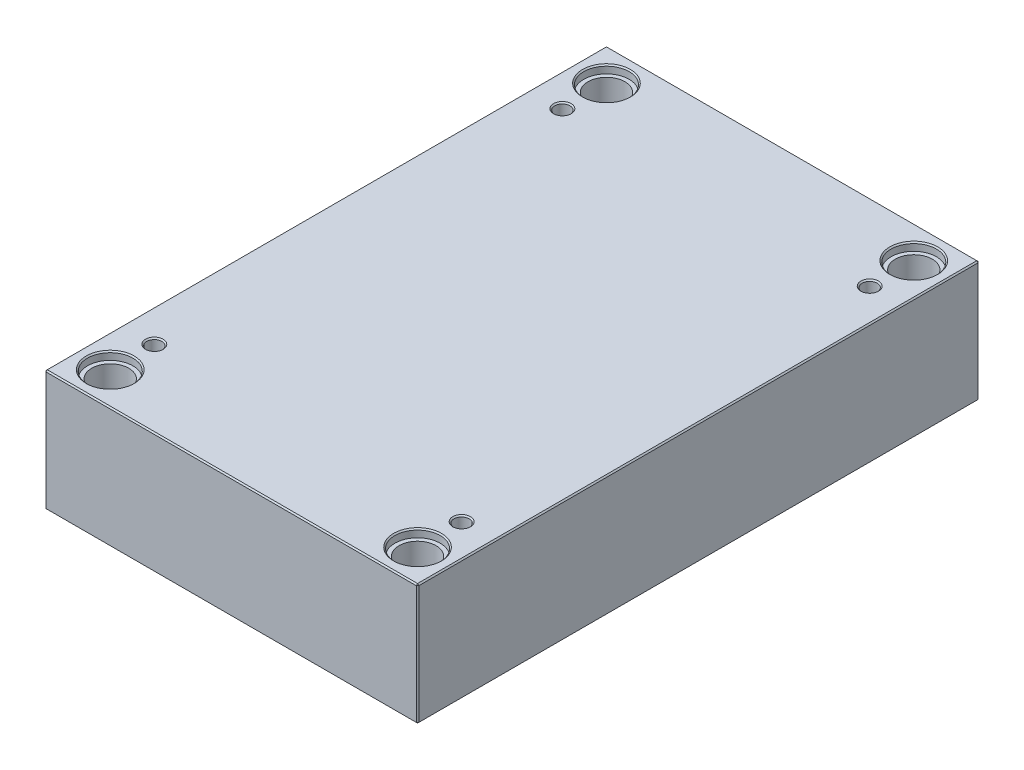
ISO-10303-21;
HEADER;
FILE_DESCRIPTION(('STEP AP214'),'2;1');
FILE_NAME('part.step','',(''),(''),'','','');
FILE_SCHEMA(('AUTOMOTIVE_DESIGN { 1 0 10303 214 1 1 1 1 }'));
ENDSEC;
DATA;
#1=APPLICATION_CONTEXT('core data for automotive mechanical design processes');
#2=APPLICATION_PROTOCOL_DEFINITION('international standard','automotive_design',2000,#1);
#3=PRODUCT_CONTEXT('',#1,'mechanical');
#4=PRODUCT('Part','Part','',(#3));
#5=PRODUCT_RELATED_PRODUCT_CATEGORY('part','',(#4));
#6=PRODUCT_DEFINITION_FORMATION('','',#4);
#7=PRODUCT_DEFINITION_CONTEXT('part definition',#1,'design');
#8=PRODUCT_DEFINITION('design','',#6,#7);
#9=PRODUCT_DEFINITION_SHAPE('','',#8);
#10=(LENGTH_UNIT() NAMED_UNIT(*) SI_UNIT(.MILLI.,.METRE.));
#11=(NAMED_UNIT(*) PLANE_ANGLE_UNIT() SI_UNIT($,.RADIAN.));
#12=(NAMED_UNIT(*) SI_UNIT($,.STERADIAN.) SOLID_ANGLE_UNIT());
#13=UNCERTAINTY_MEASURE_WITH_UNIT(LENGTH_MEASURE(1.E-05),#10,'distance_accuracy_value','');
#14=(GEOMETRIC_REPRESENTATION_CONTEXT(3) GLOBAL_UNCERTAINTY_ASSIGNED_CONTEXT((#13)) GLOBAL_UNIT_ASSIGNED_CONTEXT((#10,
#11,#12)) REPRESENTATION_CONTEXT('',''));
#15=CARTESIAN_POINT('',(0.,0.,0.));
#16=DIRECTION('',(0.,0.,1.));
#17=DIRECTION('',(1.,0.,0.));
#18=AXIS2_PLACEMENT_3D('',#15,#16,#17);
#19=CARTESIAN_POINT('',(-122.,0.,-197.));
#20=DIRECTION('',(0.,1.,0.));
#21=DIRECTION('',(0.,0.,1.));
#22=AXIS2_PLACEMENT_3D('',#19,#20,#21);
#23=CYLINDRICAL_SURFACE('',#22,14.7);
#24=CARTESIAN_POINT('',(-122.,0.999999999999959,-197.));
#25=DIRECTION('',(0.,1.,0.));
#26=DIRECTION('',(0.,0.,1.));
#27=AXIS2_PLACEMENT_3D('',#24,#25,#26);
#28=CIRCLE('',#27,14.7);
#29=CARTESIAN_POINT('',(-122.,0.999999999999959,-182.3));
#30=VERTEX_POINT('',#29);
#31=EDGE_CURVE('E471',#30,#30,#28,.F.);
#32=ORIENTED_EDGE('',*,*,#31,.T.);
#33=EDGE_LOOP('',(#32));
#34=FACE_BOUND('',#33,.T.);
#35=CARTESIAN_POINT('',(-122.,89.7,-197.));
#36=DIRECTION('',(0.,1.,0.));
#37=DIRECTION('',(0.,0.,1.));
#38=AXIS2_PLACEMENT_3D('',#35,#36,#37);
#39=CIRCLE('',#38,14.7);
#40=CARTESIAN_POINT('',(-122.,89.7,-182.3));
#41=VERTEX_POINT('',#40);
#42=EDGE_CURVE('E220',#41,#41,#39,.F.);
#43=ORIENTED_EDGE('',*,*,#42,.F.);
#44=EDGE_LOOP('',(#43));
#45=FACE_BOUND('',#44,.T.);
#46=ADVANCED_FACE('F15',(#34,#45),#23,.F.);
#47=CARTESIAN_POINT('',(122.,0.,-197.));
#48=DIRECTION('',(0.,1.,0.));
#49=DIRECTION('',(0.,0.,1.));
#50=AXIS2_PLACEMENT_3D('',#47,#48,#49);
#51=CYLINDRICAL_SURFACE('',#50,14.7);
#52=CARTESIAN_POINT('',(122.,0.999999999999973,-197.));
#53=DIRECTION('',(0.,1.,0.));
#54=DIRECTION('',(0.,0.,1.));
#55=AXIS2_PLACEMENT_3D('',#52,#53,#54);
#56=CIRCLE('',#55,14.7);
#57=CARTESIAN_POINT('',(122.,0.999999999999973,-182.3));
#58=VERTEX_POINT('',#57);
#59=EDGE_CURVE('E473',#58,#58,#56,.F.);
#60=ORIENTED_EDGE('',*,*,#59,.T.);
#61=EDGE_LOOP('',(#60));
#62=FACE_BOUND('',#61,.T.);
#63=CARTESIAN_POINT('',(122.,89.7,-197.));
#64=DIRECTION('',(0.,1.,0.));
#65=DIRECTION('',(0.,0.,1.));
#66=AXIS2_PLACEMENT_3D('',#63,#64,#65);
#67=CIRCLE('',#66,14.7);
#68=CARTESIAN_POINT('',(122.,89.7,-182.3));
#69=VERTEX_POINT('',#68);
#70=EDGE_CURVE('E217',#69,#69,#67,.F.);
#71=ORIENTED_EDGE('',*,*,#70,.F.);
#72=EDGE_LOOP('',(#71));
#73=FACE_BOUND('',#72,.T.);
#74=ADVANCED_FACE('F262',(#62,#73),#51,.F.);
#75=CARTESIAN_POINT('',(122.,0.,197.));
#76=DIRECTION('',(0.,1.,0.));
#77=DIRECTION('',(0.,0.,1.));
#78=AXIS2_PLACEMENT_3D('',#75,#76,#77);
#79=CYLINDRICAL_SURFACE('',#78,14.7);
#80=CARTESIAN_POINT('',(122.,0.999999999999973,197.));
#81=DIRECTION('',(0.,1.,0.));
#82=DIRECTION('',(0.,0.,1.));
#83=AXIS2_PLACEMENT_3D('',#80,#81,#82);
#84=CIRCLE('',#83,14.7);
#85=CARTESIAN_POINT('',(122.,0.999999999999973,211.7));
#86=VERTEX_POINT('',#85);
#87=EDGE_CURVE('E476',#86,#86,#84,.F.);
#88=ORIENTED_EDGE('',*,*,#87,.T.);
#89=EDGE_LOOP('',(#88));
#90=FACE_BOUND('',#89,.T.);
#91=CARTESIAN_POINT('',(122.,89.7,197.));
#92=DIRECTION('',(0.,1.,0.));
#93=DIRECTION('',(0.,0.,1.));
#94=AXIS2_PLACEMENT_3D('',#91,#92,#93);
#95=CIRCLE('',#94,14.7);
#96=CARTESIAN_POINT('',(122.,89.7,211.7));
#97=VERTEX_POINT('',#96);
#98=EDGE_CURVE('E213',#97,#97,#95,.F.);
#99=ORIENTED_EDGE('',*,*,#98,.F.);
#100=EDGE_LOOP('',(#99));
#101=FACE_BOUND('',#100,.T.);
#102=ADVANCED_FACE('F269',(#90,#101),#79,.F.);
#103=CARTESIAN_POINT('',(-122.,0.,197.));
#104=DIRECTION('',(0.,1.,0.));
#105=DIRECTION('',(0.,0.,1.));
#106=AXIS2_PLACEMENT_3D('',#103,#104,#105);
#107=CYLINDRICAL_SURFACE('',#106,14.7);
#108=CARTESIAN_POINT('',(-122.,0.999999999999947,197.));
#109=DIRECTION('',(0.,1.,0.));
#110=DIRECTION('',(0.,0.,1.));
#111=AXIS2_PLACEMENT_3D('',#108,#109,#110);
#112=CIRCLE('',#111,14.7);
#113=CARTESIAN_POINT('',(-122.,0.999999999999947,211.7));
#114=VERTEX_POINT('',#113);
#115=EDGE_CURVE('E479',#114,#114,#112,.F.);
#116=ORIENTED_EDGE('',*,*,#115,.T.);
#117=EDGE_LOOP('',(#116));
#118=FACE_BOUND('',#117,.T.);
#119=CARTESIAN_POINT('',(-122.,89.7,197.));
#120=DIRECTION('',(0.,1.,0.));
#121=DIRECTION('',(0.,0.,1.));
#122=AXIS2_PLACEMENT_3D('',#119,#120,#121);
#123=CIRCLE('',#122,14.7);
#124=CARTESIAN_POINT('',(-122.,89.7,211.7));
#125=VERTEX_POINT('',#124);
#126=EDGE_CURVE('E210',#125,#125,#123,.F.);
#127=ORIENTED_EDGE('',*,*,#126,.F.);
#128=EDGE_LOOP('',(#127));
#129=FACE_BOUND('',#128,.T.);
#130=ADVANCED_FACE('F276',(#118,#129),#107,.F.);
#131=CARTESIAN_POINT('',(-148.,96.,223.));
#132=DIRECTION('',(1.,0.,0.));
#133=DIRECTION('',(0.,0.,-1.));
#134=AXIS2_PLACEMENT_3D('',#131,#132,#133);
#135=PLANE('',#134);
#136=DIRECTION('',(0.,-1.,0.));
#137=VECTOR('',#136,1.);
#138=CARTESIAN_POINT('',(-148.,96.,-222.));
#139=LINE('',#138,#137);
#140=CARTESIAN_POINT('',(-148.,95.,-222.));
#141=VERTEX_POINT('',#140);
#142=CARTESIAN_POINT('',(-148.,1.,-222.));
#143=VERTEX_POINT('',#142);
#144=EDGE_CURVE('E486',#141,#143,#139,.T.);
#145=ORIENTED_EDGE('',*,*,#144,.T.);
#146=DIRECTION('',(0.,0.,1.));
#147=VECTOR('',#146,1.);
#148=CARTESIAN_POINT('',(-148.,1.,223.));
#149=LINE('',#148,#147);
#150=CARTESIAN_POINT('',(-148.,1.,222.));
#151=VERTEX_POINT('',#150);
#152=EDGE_CURVE('E489',#143,#151,#149,.T.);
#153=ORIENTED_EDGE('',*,*,#152,.T.);
#154=DIRECTION('',(0.,1.,0.));
#155=VECTOR('',#154,1.);
#156=CARTESIAN_POINT('',(-148.,96.,222.));
#157=LINE('',#156,#155);
#158=CARTESIAN_POINT('',(-148.,95.,222.));
#159=VERTEX_POINT('',#158);
#160=EDGE_CURVE('E484',#151,#159,#157,.T.);
#161=ORIENTED_EDGE('',*,*,#160,.T.);
#162=DIRECTION('',(0.,0.,-1.));
#163=VECTOR('',#162,1.);
#164=CARTESIAN_POINT('',(-148.,95.,-223.));
#165=LINE('',#164,#163);
#166=EDGE_CURVE('E482',#159,#141,#165,.T.);
#167=ORIENTED_EDGE('',*,*,#166,.T.);
#168=EDGE_LOOP('',(#145,#153,#161,#167));
#169=FACE_BOUND('',#168,.T.);
#170=ADVANCED_FACE('F297',(#169),#135,.F.);
#171=CARTESIAN_POINT('',(148.,96.,223.));
#172=DIRECTION('',(0.,0.,-1.));
#173=DIRECTION('',(-1.,0.,0.));
#174=AXIS2_PLACEMENT_3D('',#171,#172,#173);
#175=PLANE('',#174);
#176=DIRECTION('',(-1.,0.,0.));
#177=VECTOR('',#176,1.);
#178=CARTESIAN_POINT('',(-148.,95.,223.));
#179=LINE('',#178,#177);
#180=CARTESIAN_POINT('',(147.,95.,223.));
#181=VERTEX_POINT('',#180);
#182=CARTESIAN_POINT('',(-147.,95.,223.));
#183=VERTEX_POINT('',#182);
#184=EDGE_CURVE('E508',#181,#183,#179,.T.);
#185=ORIENTED_EDGE('',*,*,#184,.T.);
#186=DIRECTION('',(0.,-1.,0.));
#187=VECTOR('',#186,1.);
#188=CARTESIAN_POINT('',(-147.,96.,223.));
#189=LINE('',#188,#187);
#190=CARTESIAN_POINT('',(-147.,1.,223.));
#191=VERTEX_POINT('',#190);
#192=EDGE_CURVE('E514',#183,#191,#189,.T.);
#193=ORIENTED_EDGE('',*,*,#192,.T.);
#194=DIRECTION('',(1.,0.,0.));
#195=VECTOR('',#194,1.);
#196=CARTESIAN_POINT('',(148.,1.,223.));
#197=LINE('',#196,#195);
#198=CARTESIAN_POINT('',(147.,1.,223.));
#199=VERTEX_POINT('',#198);
#200=EDGE_CURVE('E512',#191,#199,#197,.T.);
#201=ORIENTED_EDGE('',*,*,#200,.T.);
#202=DIRECTION('',(0.,1.,0.));
#203=VECTOR('',#202,1.);
#204=CARTESIAN_POINT('',(147.,96.,223.));
#205=LINE('',#204,#203);
#206=EDGE_CURVE('E510',#199,#181,#205,.T.);
#207=ORIENTED_EDGE('',*,*,#206,.T.);
#208=EDGE_LOOP('',(#185,#193,#201,#207));
#209=FACE_BOUND('',#208,.T.);
#210=ADVANCED_FACE('F293',(#209),#175,.F.);
#211=CARTESIAN_POINT('',(148.,96.,223.));
#212=DIRECTION('',(-1.,0.,0.));
#213=DIRECTION('',(0.,0.,1.));
#214=AXIS2_PLACEMENT_3D('',#211,#212,#213);
#215=PLANE('',#214);
#216=DIRECTION('',(0.,0.,-1.));
#217=VECTOR('',#216,1.);
#218=CARTESIAN_POINT('',(148.,1.,223.));
#219=LINE('',#218,#217);
#220=CARTESIAN_POINT('',(148.,1.,222.));
#221=VERTEX_POINT('',#220);
#222=CARTESIAN_POINT('',(148.,1.,-222.));
#223=VERTEX_POINT('',#222);
#224=EDGE_CURVE('E503',#221,#223,#219,.T.);
#225=ORIENTED_EDGE('',*,*,#224,.T.);
#226=DIRECTION('',(0.,1.,0.));
#227=VECTOR('',#226,1.);
#228=CARTESIAN_POINT('',(148.,96.,-222.));
#229=LINE('',#228,#227);
#230=CARTESIAN_POINT('',(148.,95.,-222.));
#231=VERTEX_POINT('',#230);
#232=EDGE_CURVE('E505',#223,#231,#229,.T.);
#233=ORIENTED_EDGE('',*,*,#232,.T.);
#234=DIRECTION('',(0.,0.,1.));
#235=VECTOR('',#234,1.);
#236=CARTESIAN_POINT('',(148.,95.,223.));
#237=LINE('',#236,#235);
#238=CARTESIAN_POINT('',(148.,95.,222.));
#239=VERTEX_POINT('',#238);
#240=EDGE_CURVE('E499',#231,#239,#237,.T.);
#241=ORIENTED_EDGE('',*,*,#240,.T.);
#242=DIRECTION('',(0.,-1.,0.));
#243=VECTOR('',#242,1.);
#244=CARTESIAN_POINT('',(148.,96.,222.));
#245=LINE('',#244,#243);
#246=EDGE_CURVE('E501',#239,#221,#245,.T.);
#247=ORIENTED_EDGE('',*,*,#246,.T.);
#248=EDGE_LOOP('',(#225,#233,#241,#247));
#249=FACE_BOUND('',#248,.T.);
#250=ADVANCED_FACE('F289',(#249),#215,.F.);
#251=CARTESIAN_POINT('',(148.,96.,-223.));
#252=DIRECTION('',(0.,0.,1.));
#253=DIRECTION('',(1.,0.,0.));
#254=AXIS2_PLACEMENT_3D('',#251,#252,#253);
#255=PLANE('',#254);
#256=DIRECTION('',(0.,-1.,0.));
#257=VECTOR('',#256,1.);
#258=CARTESIAN_POINT('',(147.,96.,-223.));
#259=LINE('',#258,#257);
#260=CARTESIAN_POINT('',(147.,95.,-223.));
#261=VERTEX_POINT('',#260);
#262=CARTESIAN_POINT('',(147.,1.,-223.));
#263=VERTEX_POINT('',#262);
#264=EDGE_CURVE('E493',#261,#263,#259,.T.);
#265=ORIENTED_EDGE('',*,*,#264,.T.);
#266=DIRECTION('',(-1.,0.,0.));
#267=VECTOR('',#266,1.);
#268=CARTESIAN_POINT('',(148.,1.,-223.));
#269=LINE('',#268,#267);
#270=CARTESIAN_POINT('',(-147.,1.,-223.));
#271=VERTEX_POINT('',#270);
#272=EDGE_CURVE('E137',#263,#271,#269,.T.);
#273=ORIENTED_EDGE('',*,*,#272,.T.);
#274=DIRECTION('',(0.,1.,0.));
#275=VECTOR('',#274,1.);
#276=CARTESIAN_POINT('',(-147.,96.,-223.));
#277=LINE('',#276,#275);
#278=CARTESIAN_POINT('',(-147.,95.,-223.));
#279=VERTEX_POINT('',#278);
#280=EDGE_CURVE('E495',#271,#279,#277,.T.);
#281=ORIENTED_EDGE('',*,*,#280,.T.);
#282=DIRECTION('',(1.,0.,0.));
#283=VECTOR('',#282,1.);
#284=CARTESIAN_POINT('',(148.,95.,-223.));
#285=LINE('',#284,#283);
#286=EDGE_CURVE('E491',#279,#261,#285,.T.);
#287=ORIENTED_EDGE('',*,*,#286,.T.);
#288=EDGE_LOOP('',(#265,#273,#281,#287));
#289=FACE_BOUND('',#288,.T.);
#290=ADVANCED_FACE('F281',(#289),#255,.F.);
#291=CARTESIAN_POINT('',(0.,96.,0.));
#292=DIRECTION('',(0.,1.,0.));
#293=DIRECTION('',(0.,0.,1.));
#294=AXIS2_PLACEMENT_3D('',#291,#292,#293);
#295=PLANE('',#294);
#296=CARTESIAN_POINT('',(122.,96.,197.));
#297=DIRECTION('',(0.,1.,0.));
#298=DIRECTION('',(0.,0.,1.));
#299=AXIS2_PLACEMENT_3D('',#296,#297,#298);
#300=CIRCLE('',#299,19.);
#301=CARTESIAN_POINT('',(122.,96.,216.));
#302=VERTEX_POINT('',#301);
#303=EDGE_CURVE('E235',#302,#302,#300,.F.);
#304=ORIENTED_EDGE('',*,*,#303,.T.);
#305=EDGE_LOOP('',(#304));
#306=FACE_BOUND('',#305,.T.);
#307=CARTESIAN_POINT('',(-122.,96.,197.));
#308=DIRECTION('',(0.,1.,0.));
#309=DIRECTION('',(0.,0.,1.));
#310=AXIS2_PLACEMENT_3D('',#307,#308,#309);
#311=CIRCLE('',#310,19.);
#312=CARTESIAN_POINT('',(-122.,96.,216.));
#313=VERTEX_POINT('',#312);
#314=EDGE_CURVE('E232',#313,#313,#311,.F.);
#315=ORIENTED_EDGE('',*,*,#314,.T.);
#316=EDGE_LOOP('',(#315));
#317=FACE_BOUND('',#316,.T.);
#318=CARTESIAN_POINT('',(122.,96.,-197.));
#319=DIRECTION('',(0.,1.,0.));
#320=DIRECTION('',(0.,0.,1.));
#321=AXIS2_PLACEMENT_3D('',#318,#319,#320);
#322=CIRCLE('',#321,19.);
#323=CARTESIAN_POINT('',(122.,96.,-178.));
#324=VERTEX_POINT('',#323);
#325=EDGE_CURVE('E229',#324,#324,#322,.F.);
#326=ORIENTED_EDGE('',*,*,#325,.T.);
#327=EDGE_LOOP('',(#326));
#328=FACE_BOUND('',#327,.T.);
#329=CARTESIAN_POINT('',(-122.,96.,-197.));
#330=DIRECTION('',(0.,1.,0.));
#331=DIRECTION('',(0.,0.,1.));
#332=AXIS2_PLACEMENT_3D('',#329,#330,#331);
#333=CIRCLE('',#332,19.);
#334=CARTESIAN_POINT('',(-122.,96.,-178.));
#335=VERTEX_POINT('',#334);
#336=EDGE_CURVE('E226',#335,#335,#333,.F.);
#337=ORIENTED_EDGE('',*,*,#336,.T.);
#338=EDGE_LOOP('',(#337));
#339=FACE_BOUND('',#338,.T.);
#340=CARTESIAN_POINT('',(-122.,96.,162.));
#341=DIRECTION('',(0.,1.,0.));
#342=DIRECTION('',(0.,0.,1.));
#343=AXIS2_PLACEMENT_3D('',#340,#341,#342);
#344=CIRCLE('',#343,7.);
#345=CARTESIAN_POINT('',(-122.,96.,169.));
#346=VERTEX_POINT('',#345);
#347=EDGE_CURVE('E197',#346,#346,#344,.F.);
#348=ORIENTED_EDGE('',*,*,#347,.T.);
#349=EDGE_LOOP('',(#348));
#350=FACE_BOUND('',#349,.T.);
#351=CARTESIAN_POINT('',(122.,96.,162.));
#352=DIRECTION('',(0.,1.,0.));
#353=DIRECTION('',(0.,0.,1.));
#354=AXIS2_PLACEMENT_3D('',#351,#352,#353);
#355=CIRCLE('',#354,7.);
#356=CARTESIAN_POINT('',(122.,96.,169.));
#357=VERTEX_POINT('',#356);
#358=EDGE_CURVE('E194',#357,#357,#355,.F.);
#359=ORIENTED_EDGE('',*,*,#358,.T.);
#360=EDGE_LOOP('',(#359));
#361=FACE_BOUND('',#360,.T.);
#362=CARTESIAN_POINT('',(122.,96.,-162.));
#363=DIRECTION('',(0.,1.,0.));
#364=DIRECTION('',(0.,0.,1.));
#365=AXIS2_PLACEMENT_3D('',#362,#363,#364);
#366=CIRCLE('',#365,7.);
#367=CARTESIAN_POINT('',(122.,96.,-155.));
#368=VERTEX_POINT('',#367);
#369=EDGE_CURVE('E191',#368,#368,#366,.F.);
#370=ORIENTED_EDGE('',*,*,#369,.T.);
#371=EDGE_LOOP('',(#370));
#372=FACE_BOUND('',#371,.T.);
#373=CARTESIAN_POINT('',(-122.,96.,-162.));
#374=DIRECTION('',(0.,1.,0.));
#375=DIRECTION('',(0.,0.,1.));
#376=AXIS2_PLACEMENT_3D('',#373,#374,#375);
#377=CIRCLE('',#376,7.);
#378=CARTESIAN_POINT('',(-122.,96.,-155.));
#379=VERTEX_POINT('',#378);
#380=EDGE_CURVE('E187',#379,#379,#377,.F.);
#381=ORIENTED_EDGE('',*,*,#380,.T.);
#382=EDGE_LOOP('',(#381));
#383=FACE_BOUND('',#382,.T.);
#384=DIRECTION('',(0.,0.,-1.));
#385=VECTOR('',#384,1.);
#386=CARTESIAN_POINT('',(147.,96.,-223.));
#387=LINE('',#386,#385);
#388=CARTESIAN_POINT('',(147.,96.,222.));
#389=VERTEX_POINT('',#388);
#390=CARTESIAN_POINT('',(147.,96.,-222.));
#391=VERTEX_POINT('',#390);
#392=EDGE_CURVE('E30',#389,#391,#387,.T.);
#393=ORIENTED_EDGE('',*,*,#392,.T.);
#394=DIRECTION('',(-1.,0.,0.));
#395=VECTOR('',#394,1.);
#396=CARTESIAN_POINT('',(-148.,96.,-222.));
#397=LINE('',#396,#395);
#398=CARTESIAN_POINT('',(-147.,96.,-222.));
#399=VERTEX_POINT('',#398);
#400=EDGE_CURVE('E188',#391,#399,#397,.T.);
#401=ORIENTED_EDGE('',*,*,#400,.T.);
#402=DIRECTION('',(0.,0.,1.));
#403=VECTOR('',#402,1.);
#404=CARTESIAN_POINT('',(-147.,96.,223.));
#405=LINE('',#404,#403);
#406=CARTESIAN_POINT('',(-147.,96.,222.));
#407=VERTEX_POINT('',#406);
#408=EDGE_CURVE('E517',#399,#407,#405,.T.);
#409=ORIENTED_EDGE('',*,*,#408,.T.);
#410=DIRECTION('',(1.,0.,0.));
#411=VECTOR('',#410,1.);
#412=CARTESIAN_POINT('',(148.,96.,222.));
#413=LINE('',#412,#411);
#414=EDGE_CURVE('E35',#407,#389,#413,.T.);
#415=ORIENTED_EDGE('',*,*,#414,.T.);
#416=EDGE_LOOP('',(#393,#401,#409,#415));
#417=FACE_BOUND('',#416,.T.);
#418=ADVANCED_FACE('F278',(#306,#317,#328,#339,#350,#361,#372,#383,#417),#295,.T.);
#419=CARTESIAN_POINT('',(0.,0.,0.));
#420=DIRECTION('',(0.,1.,0.));
#421=DIRECTION('',(0.,0.,1.));
#422=AXIS2_PLACEMENT_3D('',#419,#420,#421);
#423=PLANE('',#422);
#424=CARTESIAN_POINT('',(-122.,0.,-197.));
#425=DIRECTION('',(0.,1.,0.));
#426=DIRECTION('',(0.,0.,1.));
#427=AXIS2_PLACEMENT_3D('',#424,#425,#426);
#428=CIRCLE('',#427,15.7);
#429=CARTESIAN_POINT('',(-122.,0.,-181.3));
#430=VERTEX_POINT('',#429);
#431=EDGE_CURVE('E468',#430,#430,#428,.T.);
#432=ORIENTED_EDGE('',*,*,#431,.T.);
#433=EDGE_LOOP('',(#432));
#434=FACE_BOUND('',#433,.T.);
#435=CARTESIAN_POINT('',(122.,0.,-197.));
#436=DIRECTION('',(0.,1.,0.));
#437=DIRECTION('',(0.,0.,1.));
#438=AXIS2_PLACEMENT_3D('',#435,#436,#437);
#439=CIRCLE('',#438,15.7);
#440=CARTESIAN_POINT('',(122.,0.,-181.3));
#441=VERTEX_POINT('',#440);
#442=EDGE_CURVE('E465',#441,#441,#439,.T.);
#443=ORIENTED_EDGE('',*,*,#442,.T.);
#444=EDGE_LOOP('',(#443));
#445=FACE_BOUND('',#444,.T.);
#446=CARTESIAN_POINT('',(122.,0.,197.));
#447=DIRECTION('',(0.,1.,0.));
#448=DIRECTION('',(0.,0.,1.));
#449=AXIS2_PLACEMENT_3D('',#446,#447,#448);
#450=CIRCLE('',#449,15.7);
#451=CARTESIAN_POINT('',(122.,0.,212.7));
#452=VERTEX_POINT('',#451);
#453=EDGE_CURVE('E462',#452,#452,#450,.T.);
#454=ORIENTED_EDGE('',*,*,#453,.T.);
#455=EDGE_LOOP('',(#454));
#456=FACE_BOUND('',#455,.T.);
#457=CARTESIAN_POINT('',(-122.,0.,197.));
#458=DIRECTION('',(0.,1.,0.));
#459=DIRECTION('',(0.,0.,1.));
#460=AXIS2_PLACEMENT_3D('',#457,#458,#459);
#461=CIRCLE('',#460,15.7);
#462=CARTESIAN_POINT('',(-122.,0.,212.7));
#463=VERTEX_POINT('',#462);
#464=EDGE_CURVE('E459',#463,#463,#461,.T.);
#465=ORIENTED_EDGE('',*,*,#464,.T.);
#466=EDGE_LOOP('',(#465));
#467=FACE_BOUND('',#466,.T.);
#468=DIRECTION('',(0.,0.,1.));
#469=VECTOR('',#468,1.);
#470=CARTESIAN_POINT('',(147.,0.,0.));
#471=LINE('',#470,#469);
#472=CARTESIAN_POINT('',(147.,0.,-222.));
#473=VERTEX_POINT('',#472);
#474=CARTESIAN_POINT('',(147.,0.,222.));
#475=VERTEX_POINT('',#474);
#476=EDGE_CURVE('E107',#473,#475,#471,.T.);
#477=ORIENTED_EDGE('',*,*,#476,.T.);
#478=DIRECTION('',(-1.,0.,0.));
#479=VECTOR('',#478,1.);
#480=CARTESIAN_POINT('',(0.,0.,222.));
#481=LINE('',#480,#479);
#482=CARTESIAN_POINT('',(-147.,0.,222.));
#483=VERTEX_POINT('',#482);
#484=EDGE_CURVE('E457',#475,#483,#481,.T.);
#485=ORIENTED_EDGE('',*,*,#484,.T.);
#486=DIRECTION('',(0.,0.,-1.));
#487=VECTOR('',#486,1.);
#488=CARTESIAN_POINT('',(-147.,0.,0.));
#489=LINE('',#488,#487);
#490=CARTESIAN_POINT('',(-147.,0.,-222.));
#491=VERTEX_POINT('',#490);
#492=EDGE_CURVE('E109',#483,#491,#489,.T.);
#493=ORIENTED_EDGE('',*,*,#492,.T.);
#494=DIRECTION('',(1.,0.,0.));
#495=VECTOR('',#494,1.);
#496=CARTESIAN_POINT('',(0.,0.,-222.));
#497=LINE('',#496,#495);
#498=EDGE_CURVE('E103',#491,#473,#497,.T.);
#499=ORIENTED_EDGE('',*,*,#498,.T.);
#500=EDGE_LOOP('',(#477,#485,#493,#499));
#501=FACE_BOUND('',#500,.T.);
#502=ADVANCED_FACE('F105',(#434,#445,#456,#467,#501),#423,.F.);
#503=CARTESIAN_POINT('',(-122.,0.,-197.));
#504=DIRECTION('',(0.,-1.,0.));
#505=DIRECTION('',(0.,0.,-1.));
#506=AXIS2_PLACEMENT_3D('',#503,#504,#505);
#507=CONICAL_SURFACE('',#506,15.7,0.78539816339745);
#508=ORIENTED_EDGE('',*,*,#31,.F.);
#509=EDGE_LOOP('',(#508));
#510=FACE_BOUND('',#509,.T.);
#511=ORIENTED_EDGE('',*,*,#431,.F.);
#512=EDGE_LOOP('',(#511));
#513=FACE_BOUND('',#512,.T.);
#514=ADVANCED_FACE('F285',(#510,#513),#507,.F.);
#515=CARTESIAN_POINT('',(122.,0.,-197.));
#516=DIRECTION('',(0.,-1.,0.));
#517=DIRECTION('',(0.,0.,-1.));
#518=AXIS2_PLACEMENT_3D('',#515,#516,#517);
#519=CONICAL_SURFACE('',#518,15.7,0.78539816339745);
#520=ORIENTED_EDGE('',*,*,#59,.F.);
#521=EDGE_LOOP('',(#520));
#522=FACE_BOUND('',#521,.T.);
#523=ORIENTED_EDGE('',*,*,#442,.F.);
#524=EDGE_LOOP('',(#523));
#525=FACE_BOUND('',#524,.T.);
#526=ADVANCED_FACE('F304',(#522,#525),#519,.F.);
#527=CARTESIAN_POINT('',(122.,0.,197.));
#528=DIRECTION('',(0.,-1.,0.));
#529=DIRECTION('',(0.,0.,-1.));
#530=AXIS2_PLACEMENT_3D('',#527,#528,#529);
#531=CONICAL_SURFACE('',#530,15.7,0.78539816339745);
#532=ORIENTED_EDGE('',*,*,#87,.F.);
#533=EDGE_LOOP('',(#532));
#534=FACE_BOUND('',#533,.T.);
#535=ORIENTED_EDGE('',*,*,#453,.F.);
#536=EDGE_LOOP('',(#535));
#537=FACE_BOUND('',#536,.T.);
#538=ADVANCED_FACE('F308',(#534,#537),#531,.F.);
#539=CARTESIAN_POINT('',(-122.,0.,197.));
#540=DIRECTION('',(0.,-1.,0.));
#541=DIRECTION('',(0.,0.,-1.));
#542=AXIS2_PLACEMENT_3D('',#539,#540,#541);
#543=CONICAL_SURFACE('',#542,15.7,0.78539816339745);
#544=ORIENTED_EDGE('',*,*,#115,.F.);
#545=EDGE_LOOP('',(#544));
#546=FACE_BOUND('',#545,.T.);
#547=ORIENTED_EDGE('',*,*,#464,.F.);
#548=EDGE_LOOP('',(#547));
#549=FACE_BOUND('',#548,.T.);
#550=ADVANCED_FACE('F312',(#546,#549),#543,.F.);
#551=CARTESIAN_POINT('',(148.,96.,222.));
#552=DIRECTION('',(-0.707106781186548,0.,-0.707106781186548));
#553=DIRECTION('',(0.,-1.,0.));
#554=AXIS2_PLACEMENT_3D('',#551,#552,#553);
#555=PLANE('',#554);
#556=DIRECTION('',(-0.707106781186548,0.,0.707106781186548));
#557=VECTOR('',#556,1.);
#558=CARTESIAN_POINT('',(147.,95.,223.));
#559=LINE('',#558,#557);
#560=EDGE_CURVE('E125',#181,#239,#559,.F.);
#561=ORIENTED_EDGE('',*,*,#560,.F.);
#562=ORIENTED_EDGE('',*,*,#206,.F.);
#563=DIRECTION('',(0.707106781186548,0.,-0.707106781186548));
#564=VECTOR('',#563,1.);
#565=CARTESIAN_POINT('',(147.,1.,223.));
#566=LINE('',#565,#564);
#567=EDGE_CURVE('E179',#221,#199,#566,.F.);
#568=ORIENTED_EDGE('',*,*,#567,.F.);
#569=ORIENTED_EDGE('',*,*,#246,.F.);
#570=EDGE_LOOP('',(#561,#562,#568,#569));
#571=FACE_BOUND('',#570,.T.);
#572=ADVANCED_FACE('F316',(#571),#555,.F.);
#573=CARTESIAN_POINT('',(147.,95.,223.));
#574=DIRECTION('',(0.577350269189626,0.577350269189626,0.577350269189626));
#575=DIRECTION('',(0.707106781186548,0.,-0.707106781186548));
#576=AXIS2_PLACEMENT_3D('',#573,#574,#575);
#577=PLANE('',#576);
#578=DIRECTION('',(0.,-0.707106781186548,0.707106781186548));
#579=VECTOR('',#578,1.);
#580=CARTESIAN_POINT('',(147.,95.,223.));
#581=LINE('',#580,#579);
#582=EDGE_CURVE('E174',#181,#389,#581,.F.);
#583=ORIENTED_EDGE('',*,*,#582,.F.);
#584=ORIENTED_EDGE('',*,*,#560,.T.);
#585=DIRECTION('',(-0.707106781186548,0.707106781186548,0.));
#586=VECTOR('',#585,1.);
#587=CARTESIAN_POINT('',(147.5,95.5,222.));
#588=LINE('',#587,#586);
#589=EDGE_CURVE('E176',#389,#239,#588,.F.);
#590=ORIENTED_EDGE('',*,*,#589,.F.);
#591=EDGE_LOOP('',(#583,#584,#590));
#592=FACE_BOUND('',#591,.T.);
#593=ADVANCED_FACE('F384',(#592),#577,.T.);
#594=CARTESIAN_POINT('',(147.,1.,223.));
#595=DIRECTION('',(0.577350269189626,-0.577350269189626,0.577350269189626));
#596=DIRECTION('',(0.707106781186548,0.,-0.707106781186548));
#597=AXIS2_PLACEMENT_3D('',#594,#595,#596);
#598=PLANE('',#597);
#599=DIRECTION('',(-0.707106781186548,-0.707106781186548,0.));
#600=VECTOR('',#599,1.);
#601=CARTESIAN_POINT('',(147.5,0.5,222.));
#602=LINE('',#601,#600);
#603=EDGE_CURVE('E123',#221,#475,#602,.T.);
#604=ORIENTED_EDGE('',*,*,#603,.F.);
#605=ORIENTED_EDGE('',*,*,#567,.T.);
#606=DIRECTION('',(0.,0.707106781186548,0.707106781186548));
#607=VECTOR('',#606,1.);
#608=CARTESIAN_POINT('',(147.,1.,223.));
#609=LINE('',#608,#607);
#610=EDGE_CURVE('E171',#475,#199,#609,.T.);
#611=ORIENTED_EDGE('',*,*,#610,.F.);
#612=EDGE_LOOP('',(#604,#605,#611));
#613=FACE_BOUND('',#612,.T.);
#614=ADVANCED_FACE('F380',(#613),#598,.T.);
#615=CARTESIAN_POINT('',(147.,96.,0.));
#616=DIRECTION('',(0.707106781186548,0.707106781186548,0.));
#617=DIRECTION('',(0.,0.,1.));
#618=AXIS2_PLACEMENT_3D('',#615,#616,#617);
#619=PLANE('',#618);
#620=ORIENTED_EDGE('',*,*,#589,.T.);
#621=ORIENTED_EDGE('',*,*,#240,.F.);
#622=DIRECTION('',(0.707106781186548,-0.707106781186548,0.));
#623=VECTOR('',#622,1.);
#624=CARTESIAN_POINT('',(148.,95.,-222.));
#625=LINE('',#624,#623);
#626=EDGE_CURVE('E165',#391,#231,#625,.T.);
#627=ORIENTED_EDGE('',*,*,#626,.F.);
#628=ORIENTED_EDGE('',*,*,#392,.F.);
#629=EDGE_LOOP('',(#620,#621,#627,#628));
#630=FACE_BOUND('',#629,.T.);
#631=ADVANCED_FACE('F376',(#630),#619,.T.);
#632=CARTESIAN_POINT('',(0.,96.,222.));
#633=DIRECTION('',(0.,0.707106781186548,0.707106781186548));
#634=DIRECTION('',(-1.,0.,0.));
#635=AXIS2_PLACEMENT_3D('',#632,#633,#634);
#636=PLANE('',#635);
#637=ORIENTED_EDGE('',*,*,#582,.T.);
#638=ORIENTED_EDGE('',*,*,#414,.F.);
#639=DIRECTION('',(0.,0.707106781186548,-0.707106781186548));
#640=VECTOR('',#639,1.);
#641=CARTESIAN_POINT('',(-147.,95.5,222.5));
#642=LINE('',#641,#640);
#643=EDGE_CURVE('E162',#183,#407,#642,.T.);
#644=ORIENTED_EDGE('',*,*,#643,.F.);
#645=ORIENTED_EDGE('',*,*,#184,.F.);
#646=EDGE_LOOP('',(#637,#638,#644,#645));
#647=FACE_BOUND('',#646,.T.);
#648=ADVANCED_FACE('F372',(#647),#636,.T.);
#649=CARTESIAN_POINT('',(-147.,96.,223.));
#650=DIRECTION('',(0.707106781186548,0.,-0.707106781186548));
#651=DIRECTION('',(0.,-1.,0.));
#652=AXIS2_PLACEMENT_3D('',#649,#650,#651);
#653=PLANE('',#652);
#654=DIRECTION('',(0.707106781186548,0.,0.707106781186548));
#655=VECTOR('',#654,1.);
#656=CARTESIAN_POINT('',(-147.,1.,223.));
#657=LINE('',#656,#655);
#658=EDGE_CURVE('E156',#191,#151,#657,.F.);
#659=ORIENTED_EDGE('',*,*,#658,.F.);
#660=ORIENTED_EDGE('',*,*,#192,.F.);
#661=DIRECTION('',(-0.707106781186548,0.,-0.707106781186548));
#662=VECTOR('',#661,1.);
#663=CARTESIAN_POINT('',(-148.,95.,222.));
#664=LINE('',#663,#662);
#665=EDGE_CURVE('E159',#159,#183,#664,.F.);
#666=ORIENTED_EDGE('',*,*,#665,.F.);
#667=ORIENTED_EDGE('',*,*,#160,.F.);
#668=EDGE_LOOP('',(#659,#660,#666,#667));
#669=FACE_BOUND('',#668,.T.);
#670=ADVANCED_FACE('F368',(#669),#653,.F.);
#671=CARTESIAN_POINT('',(148.,1.,223.));
#672=DIRECTION('',(0.,0.707106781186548,-0.707106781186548));
#673=DIRECTION('',(1.,0.,0.));
#674=AXIS2_PLACEMENT_3D('',#671,#672,#673);
#675=PLANE('',#674);
#676=ORIENTED_EDGE('',*,*,#610,.T.);
#677=ORIENTED_EDGE('',*,*,#200,.F.);
#678=DIRECTION('',(0.,-0.707106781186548,-0.707106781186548));
#679=VECTOR('',#678,1.);
#680=CARTESIAN_POINT('',(-147.,1.,223.));
#681=LINE('',#680,#679);
#682=EDGE_CURVE('E134',#483,#191,#681,.F.);
#683=ORIENTED_EDGE('',*,*,#682,.F.);
#684=ORIENTED_EDGE('',*,*,#484,.F.);
#685=EDGE_LOOP('',(#676,#677,#683,#684));
#686=FACE_BOUND('',#685,.T.);
#687=ADVANCED_FACE('F365',(#686),#675,.F.);
#688=CARTESIAN_POINT('',(148.,1.,223.));
#689=DIRECTION('',(-0.707106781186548,0.707106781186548,0.));
#690=DIRECTION('',(0.,0.,-1.));
#691=AXIS2_PLACEMENT_3D('',#688,#689,#690);
#692=PLANE('',#691);
#693=ORIENTED_EDGE('',*,*,#603,.T.);
#694=ORIENTED_EDGE('',*,*,#476,.F.);
#695=DIRECTION('',(0.707106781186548,0.707106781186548,0.));
#696=VECTOR('',#695,1.);
#697=CARTESIAN_POINT('',(147.5,0.5,-222.));
#698=LINE('',#697,#696);
#699=EDGE_CURVE('E120',#223,#473,#698,.F.);
#700=ORIENTED_EDGE('',*,*,#699,.F.);
#701=ORIENTED_EDGE('',*,*,#224,.F.);
#702=EDGE_LOOP('',(#693,#694,#700,#701));
#703=FACE_BOUND('',#702,.T.);
#704=ADVANCED_FACE('F118',(#703),#692,.F.);
#705=CARTESIAN_POINT('',(147.,96.,-223.));
#706=DIRECTION('',(-0.707106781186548,0.,0.707106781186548));
#707=DIRECTION('',(0.,-1.,0.));
#708=AXIS2_PLACEMENT_3D('',#705,#706,#707);
#709=PLANE('',#708);
#710=DIRECTION('',(0.707106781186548,0.,0.707106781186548));
#711=VECTOR('',#710,1.);
#712=CARTESIAN_POINT('',(148.,95.,-222.));
#713=LINE('',#712,#711);
#714=EDGE_CURVE('E167',#231,#261,#713,.F.);
#715=ORIENTED_EDGE('',*,*,#714,.F.);
#716=ORIENTED_EDGE('',*,*,#232,.F.);
#717=DIRECTION('',(-0.707106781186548,0.,-0.707106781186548));
#718=VECTOR('',#717,1.);
#719=CARTESIAN_POINT('',(147.,1.,-223.));
#720=LINE('',#719,#718);
#721=EDGE_CURVE('E133',#263,#223,#720,.F.);
#722=ORIENTED_EDGE('',*,*,#721,.F.);
#723=ORIENTED_EDGE('',*,*,#264,.F.);
#724=EDGE_LOOP('',(#715,#716,#722,#723));
#725=FACE_BOUND('',#724,.T.);
#726=ADVANCED_FACE('F358',(#725),#709,.F.);
#727=CARTESIAN_POINT('',(148.,95.,-222.));
#728=DIRECTION('',(0.577350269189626,0.577350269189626,-0.577350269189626));
#729=DIRECTION('',(-0.707106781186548,0.,-0.707106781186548));
#730=AXIS2_PLACEMENT_3D('',#727,#728,#729);
#731=PLANE('',#730);
#732=ORIENTED_EDGE('',*,*,#626,.T.);
#733=ORIENTED_EDGE('',*,*,#714,.T.);
#734=DIRECTION('',(0.,0.707106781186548,0.707106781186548));
#735=VECTOR('',#734,1.);
#736=CARTESIAN_POINT('',(147.,95.5,-222.5));
#737=LINE('',#736,#735);
#738=EDGE_CURVE('E151',#391,#261,#737,.F.);
#739=ORIENTED_EDGE('',*,*,#738,.F.);
#740=EDGE_LOOP('',(#732,#733,#739));
#741=FACE_BOUND('',#740,.T.);
#742=ADVANCED_FACE('F354',(#741),#731,.T.);
#743=CARTESIAN_POINT('',(-148.,95.,222.));
#744=DIRECTION('',(-0.577350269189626,0.577350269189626,0.577350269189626));
#745=DIRECTION('',(0.707106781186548,0.,0.707106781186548));
#746=AXIS2_PLACEMENT_3D('',#743,#744,#745);
#747=PLANE('',#746);
#748=ORIENTED_EDGE('',*,*,#665,.T.);
#749=ORIENTED_EDGE('',*,*,#643,.T.);
#750=DIRECTION('',(-0.707106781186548,-0.707106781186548,0.));
#751=VECTOR('',#750,1.);
#752=CARTESIAN_POINT('',(-148.,95.,222.));
#753=LINE('',#752,#751);
#754=EDGE_CURVE('E142',#159,#407,#753,.F.);
#755=ORIENTED_EDGE('',*,*,#754,.F.);
#756=EDGE_LOOP('',(#748,#749,#755));
#757=FACE_BOUND('',#756,.T.);
#758=ADVANCED_FACE('F350',(#757),#747,.T.);
#759=CARTESIAN_POINT('',(-147.,1.,223.));
#760=DIRECTION('',(-0.577350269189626,-0.577350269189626,0.577350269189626));
#761=DIRECTION('',(0.707106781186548,0.,0.707106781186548));
#762=AXIS2_PLACEMENT_3D('',#759,#760,#761);
#763=PLANE('',#762);
#764=ORIENTED_EDGE('',*,*,#682,.T.);
#765=ORIENTED_EDGE('',*,*,#658,.T.);
#766=DIRECTION('',(-0.707106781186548,0.707106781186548,0.));
#767=VECTOR('',#766,1.);
#768=CARTESIAN_POINT('',(-147.5,0.5,222.));
#769=LINE('',#768,#767);
#770=EDGE_CURVE('E138',#483,#151,#769,.T.);
#771=ORIENTED_EDGE('',*,*,#770,.F.);
#772=EDGE_LOOP('',(#764,#765,#771));
#773=FACE_BOUND('',#772,.T.);
#774=ADVANCED_FACE('F347',(#773),#763,.T.);
#775=CARTESIAN_POINT('',(147.,1.,-223.));
#776=DIRECTION('',(0.577350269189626,-0.577350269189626,-0.577350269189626));
#777=DIRECTION('',(-0.707106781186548,0.,-0.707106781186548));
#778=AXIS2_PLACEMENT_3D('',#775,#776,#777);
#779=PLANE('',#778);
#780=ORIENTED_EDGE('',*,*,#721,.T.);
#781=ORIENTED_EDGE('',*,*,#699,.T.);
#782=DIRECTION('',(0.,-0.707106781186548,0.707106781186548));
#783=VECTOR('',#782,1.);
#784=CARTESIAN_POINT('',(147.,1.,-223.));
#785=LINE('',#784,#783);
#786=EDGE_CURVE('E130',#263,#473,#785,.T.);
#787=ORIENTED_EDGE('',*,*,#786,.F.);
#788=EDGE_LOOP('',(#780,#781,#787));
#789=FACE_BOUND('',#788,.T.);
#790=ADVANCED_FACE('F129',(#789),#779,.T.);
#791=CARTESIAN_POINT('',(0.,96.,-222.));
#792=DIRECTION('',(0.,0.707106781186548,-0.707106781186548));
#793=DIRECTION('',(1.,0.,0.));
#794=AXIS2_PLACEMENT_3D('',#791,#792,#793);
#795=PLANE('',#794);
#796=ORIENTED_EDGE('',*,*,#738,.T.);
#797=ORIENTED_EDGE('',*,*,#286,.F.);
#798=DIRECTION('',(0.,-0.707106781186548,-0.707106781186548));
#799=VECTOR('',#798,1.);
#800=CARTESIAN_POINT('',(-147.,95.,-223.));
#801=LINE('',#800,#799);
#802=EDGE_CURVE('E139',#399,#279,#801,.T.);
#803=ORIENTED_EDGE('',*,*,#802,.F.);
#804=ORIENTED_EDGE('',*,*,#400,.F.);
#805=EDGE_LOOP('',(#796,#797,#803,#804));
#806=FACE_BOUND('',#805,.T.);
#807=ADVANCED_FACE('F340',(#806),#795,.T.);
#808=CARTESIAN_POINT('',(-147.,96.,0.));
#809=DIRECTION('',(-0.707106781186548,0.707106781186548,0.));
#810=DIRECTION('',(0.,0.,-1.));
#811=AXIS2_PLACEMENT_3D('',#808,#809,#810);
#812=PLANE('',#811);
#813=ORIENTED_EDGE('',*,*,#754,.T.);
#814=ORIENTED_EDGE('',*,*,#408,.F.);
#815=DIRECTION('',(0.707106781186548,0.707106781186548,0.));
#816=VECTOR('',#815,1.);
#817=CARTESIAN_POINT('',(-147.5,95.5,-222.));
#818=LINE('',#817,#816);
#819=EDGE_CURVE('E145',#141,#399,#818,.T.);
#820=ORIENTED_EDGE('',*,*,#819,.F.);
#821=ORIENTED_EDGE('',*,*,#166,.F.);
#822=EDGE_LOOP('',(#813,#814,#820,#821));
#823=FACE_BOUND('',#822,.T.);
#824=ADVANCED_FACE('F336',(#823),#812,.T.);
#825=CARTESIAN_POINT('',(-148.,1.,223.));
#826=DIRECTION('',(0.707106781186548,0.707106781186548,0.));
#827=DIRECTION('',(0.,0.,1.));
#828=AXIS2_PLACEMENT_3D('',#825,#826,#827);
#829=PLANE('',#828);
#830=ORIENTED_EDGE('',*,*,#770,.T.);
#831=ORIENTED_EDGE('',*,*,#152,.F.);
#832=DIRECTION('',(0.707106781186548,-0.707106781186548,0.));
#833=VECTOR('',#832,1.);
#834=CARTESIAN_POINT('',(-148.,1.,-222.));
#835=LINE('',#834,#833);
#836=EDGE_CURVE('E528',#491,#143,#835,.F.);
#837=ORIENTED_EDGE('',*,*,#836,.F.);
#838=ORIENTED_EDGE('',*,*,#492,.F.);
#839=EDGE_LOOP('',(#830,#831,#837,#838));
#840=FACE_BOUND('',#839,.T.);
#841=ADVANCED_FACE('F333',(#840),#829,.F.);
#842=CARTESIAN_POINT('',(148.,1.,-223.));
#843=DIRECTION('',(0.,0.707106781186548,0.707106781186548));
#844=DIRECTION('',(-1.,0.,0.));
#845=AXIS2_PLACEMENT_3D('',#842,#843,#844);
#846=PLANE('',#845);
#847=ORIENTED_EDGE('',*,*,#786,.T.);
#848=ORIENTED_EDGE('',*,*,#498,.F.);
#849=DIRECTION('',(0.,0.707106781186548,-0.707106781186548));
#850=VECTOR('',#849,1.);
#851=CARTESIAN_POINT('',(-147.,0.5,-222.5));
#852=LINE('',#851,#850);
#853=EDGE_CURVE('E525',#271,#491,#852,.F.);
#854=ORIENTED_EDGE('',*,*,#853,.F.);
#855=ORIENTED_EDGE('',*,*,#272,.F.);
#856=EDGE_LOOP('',(#847,#848,#854,#855));
#857=FACE_BOUND('',#856,.T.);
#858=ADVANCED_FACE('F136',(#857),#846,.F.);
#859=CARTESIAN_POINT('',(-147.,95.,-223.));
#860=DIRECTION('',(-0.577350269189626,0.577350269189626,-0.577350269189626));
#861=DIRECTION('',(-0.707106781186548,0.,0.707106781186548));
#862=AXIS2_PLACEMENT_3D('',#859,#860,#861);
#863=PLANE('',#862);
#864=ORIENTED_EDGE('',*,*,#819,.T.);
#865=ORIENTED_EDGE('',*,*,#802,.T.);
#866=DIRECTION('',(0.707106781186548,0.,-0.707106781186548));
#867=VECTOR('',#866,1.);
#868=CARTESIAN_POINT('',(-147.,95.,-223.));
#869=LINE('',#868,#867);
#870=EDGE_CURVE('E523',#141,#279,#869,.T.);
#871=ORIENTED_EDGE('',*,*,#870,.F.);
#872=EDGE_LOOP('',(#864,#865,#871));
#873=FACE_BOUND('',#872,.T.);
#874=ADVANCED_FACE('F326',(#873),#863,.T.);
#875=CARTESIAN_POINT('',(-148.,1.,-222.));
#876=DIRECTION('',(-0.577350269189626,-0.577350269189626,-0.577350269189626));
#877=DIRECTION('',(-0.707106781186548,0.,0.707106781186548));
#878=AXIS2_PLACEMENT_3D('',#875,#876,#877);
#879=PLANE('',#878);
#880=ORIENTED_EDGE('',*,*,#853,.T.);
#881=ORIENTED_EDGE('',*,*,#836,.T.);
#882=DIRECTION('',(-0.707106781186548,0.,0.707106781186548));
#883=VECTOR('',#882,1.);
#884=CARTESIAN_POINT('',(-148.,1.,-222.));
#885=LINE('',#884,#883);
#886=EDGE_CURVE('E454',#271,#143,#885,.T.);
#887=ORIENTED_EDGE('',*,*,#886,.F.);
#888=EDGE_LOOP('',(#880,#881,#887));
#889=FACE_BOUND('',#888,.T.);
#890=ADVANCED_FACE('F322',(#889),#879,.T.);
#891=CARTESIAN_POINT('',(-148.,96.,-222.));
#892=DIRECTION('',(0.707106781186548,0.,0.707106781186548));
#893=DIRECTION('',(0.,-1.,0.));
#894=AXIS2_PLACEMENT_3D('',#891,#892,#893);
#895=PLANE('',#894);
#896=ORIENTED_EDGE('',*,*,#870,.T.);
#897=ORIENTED_EDGE('',*,*,#280,.F.);
#898=ORIENTED_EDGE('',*,*,#886,.T.);
#899=ORIENTED_EDGE('',*,*,#144,.F.);
#900=EDGE_LOOP('',(#896,#897,#898,#899));
#901=FACE_BOUND('',#900,.T.);
#902=ADVANCED_FACE('F318',(#901),#895,.F.);
#903=CARTESIAN_POINT('',(-122.,72.,-162.));
#904=DIRECTION('',(0.,1.,0.));
#905=DIRECTION('',(0.,0.,1.));
#906=AXIS2_PLACEMENT_3D('',#903,#904,#905);
#907=CYLINDRICAL_SURFACE('',#906,6.);
#908=CARTESIAN_POINT('',(-122.,95.,-162.));
#909=DIRECTION('',(0.,1.,0.));
#910=DIRECTION('',(0.,0.,1.));
#911=AXIS2_PLACEMENT_3D('',#908,#909,#910);
#912=CIRCLE('',#911,6.);
#913=CARTESIAN_POINT('',(-122.,95.,-156.));
#914=VERTEX_POINT('',#913);
#915=EDGE_CURVE('E206',#914,#914,#912,.T.);
#916=ORIENTED_EDGE('',*,*,#915,.T.);
#917=EDGE_LOOP('',(#916));
#918=FACE_BOUND('',#917,.T.);
#919=CARTESIAN_POINT('',(-122.,72.,-162.));
#920=DIRECTION('',(0.,1.,0.));
#921=DIRECTION('',(0.,0.,1.));
#922=AXIS2_PLACEMENT_3D('',#919,#920,#921);
#923=CIRCLE('',#922,6.);
#924=CARTESIAN_POINT('',(-122.,72.,-156.));
#925=VERTEX_POINT('',#924);
#926=EDGE_CURVE('E447',#925,#925,#923,.T.);
#927=ORIENTED_EDGE('',*,*,#926,.F.);
#928=EDGE_LOOP('',(#927));
#929=FACE_BOUND('',#928,.T.);
#930=ADVANCED_FACE('F321',(#918,#929),#907,.F.);
#931=CARTESIAN_POINT('',(-122.,72.,-162.));
#932=DIRECTION('',(0.,1.,0.));
#933=DIRECTION('',(0.,0.,1.));
#934=AXIS2_PLACEMENT_3D('',#931,#932,#933);
#935=PLANE('',#934);
#936=ORIENTED_EDGE('',*,*,#926,.T.);
#937=EDGE_LOOP('',(#936));
#938=FACE_BOUND('',#937,.T.);
#939=ADVANCED_FACE('F595',(#938),#935,.T.);
#940=CARTESIAN_POINT('',(122.,72.,-162.));
#941=DIRECTION('',(0.,1.,0.));
#942=DIRECTION('',(0.,0.,1.));
#943=AXIS2_PLACEMENT_3D('',#940,#941,#942);
#944=CYLINDRICAL_SURFACE('',#943,6.);
#945=CARTESIAN_POINT('',(122.,95.,-162.));
#946=DIRECTION('',(0.,1.,0.));
#947=DIRECTION('',(0.,0.,1.));
#948=AXIS2_PLACEMENT_3D('',#945,#946,#947);
#949=CIRCLE('',#948,6.);
#950=CARTESIAN_POINT('',(122.,95.,-156.));
#951=VERTEX_POINT('',#950);
#952=EDGE_CURVE('E203',#951,#951,#949,.T.);
#953=ORIENTED_EDGE('',*,*,#952,.T.);
#954=EDGE_LOOP('',(#953));
#955=FACE_BOUND('',#954,.T.);
#956=CARTESIAN_POINT('',(122.,72.,-162.));
#957=DIRECTION('',(0.,1.,0.));
#958=DIRECTION('',(0.,0.,1.));
#959=AXIS2_PLACEMENT_3D('',#956,#957,#958);
#960=CIRCLE('',#959,6.);
#961=CARTESIAN_POINT('',(122.,72.,-156.));
#962=VERTEX_POINT('',#961);
#963=EDGE_CURVE('E444',#962,#962,#960,.T.);
#964=ORIENTED_EDGE('',*,*,#963,.F.);
#965=EDGE_LOOP('',(#964));
#966=FACE_BOUND('',#965,.T.);
#967=ADVANCED_FACE('F591',(#955,#966),#944,.F.);
#968=CARTESIAN_POINT('',(122.,72.,-162.));
#969=DIRECTION('',(0.,1.,0.));
#970=DIRECTION('',(0.,0.,1.));
#971=AXIS2_PLACEMENT_3D('',#968,#969,#970);
#972=PLANE('',#971);
#973=ORIENTED_EDGE('',*,*,#963,.T.);
#974=EDGE_LOOP('',(#973));
#975=FACE_BOUND('',#974,.T.);
#976=ADVANCED_FACE('F587',(#975),#972,.T.);
#977=CARTESIAN_POINT('',(122.,72.,162.));
#978=DIRECTION('',(0.,1.,0.));
#979=DIRECTION('',(0.,0.,1.));
#980=AXIS2_PLACEMENT_3D('',#977,#978,#979);
#981=CYLINDRICAL_SURFACE('',#980,6.);
#982=CARTESIAN_POINT('',(122.,95.,162.));
#983=DIRECTION('',(0.,1.,0.));
#984=DIRECTION('',(0.,0.,1.));
#985=AXIS2_PLACEMENT_3D('',#982,#983,#984);
#986=CIRCLE('',#985,6.);
#987=CARTESIAN_POINT('',(122.,95.,168.));
#988=VERTEX_POINT('',#987);
#989=EDGE_CURVE('E200',#988,#988,#986,.T.);
#990=ORIENTED_EDGE('',*,*,#989,.T.);
#991=EDGE_LOOP('',(#990));
#992=FACE_BOUND('',#991,.T.);
#993=CARTESIAN_POINT('',(122.,72.,162.));
#994=DIRECTION('',(0.,1.,0.));
#995=DIRECTION('',(0.,0.,1.));
#996=AXIS2_PLACEMENT_3D('',#993,#994,#995);
#997=CIRCLE('',#996,6.);
#998=CARTESIAN_POINT('',(122.,72.,168.));
#999=VERTEX_POINT('',#998);
#1000=EDGE_CURVE('E448',#999,#999,#997,.T.);
#1001=ORIENTED_EDGE('',*,*,#1000,.F.);
#1002=EDGE_LOOP('',(#1001));
#1003=FACE_BOUND('',#1002,.T.);
#1004=ADVANCED_FACE('F590',(#992,#1003),#981,.F.);
#1005=CARTESIAN_POINT('',(122.,72.,162.));
#1006=DIRECTION('',(0.,1.,0.));
#1007=DIRECTION('',(0.,0.,1.));
#1008=AXIS2_PLACEMENT_3D('',#1005,#1006,#1007);
#1009=PLANE('',#1008);
#1010=ORIENTED_EDGE('',*,*,#1000,.T.);
#1011=EDGE_LOOP('',(#1010));
#1012=FACE_BOUND('',#1011,.T.);
#1013=ADVANCED_FACE('F597',(#1012),#1009,.T.);
#1014=CARTESIAN_POINT('',(-122.,72.,162.));
#1015=DIRECTION('',(0.,1.,0.));
#1016=DIRECTION('',(0.,0.,1.));
#1017=AXIS2_PLACEMENT_3D('',#1014,#1015,#1016);
#1018=CYLINDRICAL_SURFACE('',#1017,6.);
#1019=CARTESIAN_POINT('',(-122.,95.,162.));
#1020=DIRECTION('',(0.,1.,0.));
#1021=DIRECTION('',(0.,0.,1.));
#1022=AXIS2_PLACEMENT_3D('',#1019,#1020,#1021);
#1023=CIRCLE('',#1022,6.);
#1024=CARTESIAN_POINT('',(-122.,95.,168.));
#1025=VERTEX_POINT('',#1024);
#1026=EDGE_CURVE('E184',#1025,#1025,#1023,.T.);
#1027=ORIENTED_EDGE('',*,*,#1026,.T.);
#1028=EDGE_LOOP('',(#1027));
#1029=FACE_BOUND('',#1028,.T.);
#1030=CARTESIAN_POINT('',(-122.,72.,162.));
#1031=DIRECTION('',(0.,1.,0.));
#1032=DIRECTION('',(0.,0.,1.));
#1033=AXIS2_PLACEMENT_3D('',#1030,#1031,#1032);
#1034=CIRCLE('',#1033,6.);
#1035=CARTESIAN_POINT('',(-122.,72.,168.));
#1036=VERTEX_POINT('',#1035);
#1037=EDGE_CURVE('E223',#1036,#1036,#1034,.T.);
#1038=ORIENTED_EDGE('',*,*,#1037,.F.);
#1039=EDGE_LOOP('',(#1038));
#1040=FACE_BOUND('',#1039,.T.);
#1041=ADVANCED_FACE('F600',(#1029,#1040),#1018,.F.);
#1042=CARTESIAN_POINT('',(-122.,72.,162.));
#1043=DIRECTION('',(0.,1.,0.));
#1044=DIRECTION('',(0.,0.,1.));
#1045=AXIS2_PLACEMENT_3D('',#1042,#1043,#1044);
#1046=PLANE('',#1045);
#1047=ORIENTED_EDGE('',*,*,#1037,.T.);
#1048=EDGE_LOOP('',(#1047));
#1049=FACE_BOUND('',#1048,.T.);
#1050=ADVANCED_FACE('F396',(#1049),#1046,.T.);
#1051=CARTESIAN_POINT('',(-122.,95.,162.));
#1052=DIRECTION('',(0.,1.,0.));
#1053=DIRECTION('',(0.,0.,1.));
#1054=AXIS2_PLACEMENT_3D('',#1051,#1052,#1053);
#1055=CONICAL_SURFACE('',#1054,6.,0.785398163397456);
#1056=ORIENTED_EDGE('',*,*,#347,.F.);
#1057=EDGE_LOOP('',(#1056));
#1058=FACE_BOUND('',#1057,.T.);
#1059=ORIENTED_EDGE('',*,*,#1026,.F.);
#1060=EDGE_LOOP('',(#1059));
#1061=FACE_BOUND('',#1060,.T.);
#1062=ADVANCED_FACE('F392',(#1058,#1061),#1055,.F.);
#1063=CARTESIAN_POINT('',(122.,95.,162.));
#1064=DIRECTION('',(0.,1.,0.));
#1065=DIRECTION('',(0.,0.,1.));
#1066=AXIS2_PLACEMENT_3D('',#1063,#1064,#1065);
#1067=CONICAL_SURFACE('',#1066,6.,0.785398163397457);
#1068=ORIENTED_EDGE('',*,*,#358,.F.);
#1069=EDGE_LOOP('',(#1068));
#1070=FACE_BOUND('',#1069,.T.);
#1071=ORIENTED_EDGE('',*,*,#989,.F.);
#1072=EDGE_LOOP('',(#1071));
#1073=FACE_BOUND('',#1072,.T.);
#1074=ADVANCED_FACE('F395',(#1070,#1073),#1067,.F.);
#1075=CARTESIAN_POINT('',(122.,95.,-162.));
#1076=DIRECTION('',(0.,1.,0.));
#1077=DIRECTION('',(0.,0.,1.));
#1078=AXIS2_PLACEMENT_3D('',#1075,#1076,#1077);
#1079=CONICAL_SURFACE('',#1078,6.,0.785398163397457);
#1080=ORIENTED_EDGE('',*,*,#369,.F.);
#1081=EDGE_LOOP('',(#1080));
#1082=FACE_BOUND('',#1081,.T.);
#1083=ORIENTED_EDGE('',*,*,#952,.F.);
#1084=EDGE_LOOP('',(#1083));
#1085=FACE_BOUND('',#1084,.T.);
#1086=ADVANCED_FACE('F400',(#1082,#1085),#1079,.F.);
#1087=CARTESIAN_POINT('',(-122.,95.,-162.));
#1088=DIRECTION('',(0.,1.,0.));
#1089=DIRECTION('',(0.,0.,1.));
#1090=AXIS2_PLACEMENT_3D('',#1087,#1088,#1089);
#1091=CONICAL_SURFACE('',#1090,6.,0.785398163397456);
#1092=ORIENTED_EDGE('',*,*,#380,.F.);
#1093=EDGE_LOOP('',(#1092));
#1094=FACE_BOUND('',#1093,.T.);
#1095=ORIENTED_EDGE('',*,*,#915,.F.);
#1096=EDGE_LOOP('',(#1095));
#1097=FACE_BOUND('',#1096,.T.);
#1098=ADVANCED_FACE('F404',(#1094,#1097),#1091,.F.);
#1099=CARTESIAN_POINT('',(-122.,89.7,197.));
#1100=DIRECTION('',(0.,1.,0.));
#1101=DIRECTION('',(0.,0.,1.));
#1102=AXIS2_PLACEMENT_3D('',#1099,#1100,#1101);
#1103=PLANE('',#1102);
#1104=CARTESIAN_POINT('',(-122.,89.7,197.));
#1105=DIRECTION('',(0.,1.,0.));
#1106=DIRECTION('',(0.,0.,1.));
#1107=AXIS2_PLACEMENT_3D('',#1104,#1105,#1106);
#1108=CIRCLE('',#1107,18.);
#1109=CARTESIAN_POINT('',(-122.,89.7,215.));
#1110=VERTEX_POINT('',#1109);
#1111=EDGE_CURVE('E435',#1110,#1110,#1108,.T.);
#1112=ORIENTED_EDGE('',*,*,#1111,.T.);
#1113=EDGE_LOOP('',(#1112));
#1114=FACE_BOUND('',#1113,.T.);
#1115=ORIENTED_EDGE('',*,*,#126,.T.);
#1116=EDGE_LOOP('',(#1115));
#1117=FACE_BOUND('',#1116,.T.);
#1118=ADVANCED_FACE('F408',(#1114,#1117),#1103,.T.);
#1119=CARTESIAN_POINT('',(-122.,89.7,197.));
#1120=DIRECTION('',(0.,1.,0.));
#1121=DIRECTION('',(0.,0.,1.));
#1122=AXIS2_PLACEMENT_3D('',#1119,#1120,#1121);
#1123=CYLINDRICAL_SURFACE('',#1122,18.);
#1124=CARTESIAN_POINT('',(-122.,95.,197.));
#1125=DIRECTION('',(0.,1.,0.));
#1126=DIRECTION('',(0.,0.,1.));
#1127=AXIS2_PLACEMENT_3D('',#1124,#1125,#1126);
#1128=CIRCLE('',#1127,18.);
#1129=CARTESIAN_POINT('',(-122.,95.,215.));
#1130=VERTEX_POINT('',#1129);
#1131=EDGE_CURVE('E238',#1130,#1130,#1128,.T.);
#1132=ORIENTED_EDGE('',*,*,#1131,.T.);
#1133=EDGE_LOOP('',(#1132));
#1134=FACE_BOUND('',#1133,.T.);
#1135=ORIENTED_EDGE('',*,*,#1111,.F.);
#1136=EDGE_LOOP('',(#1135));
#1137=FACE_BOUND('',#1136,.T.);
#1138=ADVANCED_FACE('F573',(#1134,#1137),#1123,.F.);
#1139=CARTESIAN_POINT('',(122.,89.7,197.));
#1140=DIRECTION('',(0.,1.,0.));
#1141=DIRECTION('',(0.,0.,1.));
#1142=AXIS2_PLACEMENT_3D('',#1139,#1140,#1141);
#1143=PLANE('',#1142);
#1144=CARTESIAN_POINT('',(122.,89.7,197.));
#1145=DIRECTION('',(0.,1.,0.));
#1146=DIRECTION('',(0.,0.,1.));
#1147=AXIS2_PLACEMENT_3D('',#1144,#1145,#1146);
#1148=CIRCLE('',#1147,18.);
#1149=CARTESIAN_POINT('',(122.,89.7,215.));
#1150=VERTEX_POINT('',#1149);
#1151=EDGE_CURVE('E432',#1150,#1150,#1148,.T.);
#1152=ORIENTED_EDGE('',*,*,#1151,.T.);
#1153=EDGE_LOOP('',(#1152));
#1154=FACE_BOUND('',#1153,.T.);
#1155=ORIENTED_EDGE('',*,*,#98,.T.);
#1156=EDGE_LOOP('',(#1155));
#1157=FACE_BOUND('',#1156,.T.);
#1158=ADVANCED_FACE('F428',(#1154,#1157),#1143,.T.);
#1159=CARTESIAN_POINT('',(122.,89.7,197.));
#1160=DIRECTION('',(0.,1.,0.));
#1161=DIRECTION('',(0.,0.,1.));
#1162=AXIS2_PLACEMENT_3D('',#1159,#1160,#1161);
#1163=CYLINDRICAL_SURFACE('',#1162,18.);
#1164=CARTESIAN_POINT('',(122.,95.,197.));
#1165=DIRECTION('',(0.,1.,0.));
#1166=DIRECTION('',(0.,0.,1.));
#1167=AXIS2_PLACEMENT_3D('',#1164,#1165,#1166);
#1168=CIRCLE('',#1167,18.);
#1169=CARTESIAN_POINT('',(122.,95.,215.));
#1170=VERTEX_POINT('',#1169);
#1171=EDGE_CURVE('E209',#1170,#1170,#1168,.T.);
#1172=ORIENTED_EDGE('',*,*,#1171,.T.);
#1173=EDGE_LOOP('',(#1172));
#1174=FACE_BOUND('',#1173,.T.);
#1175=ORIENTED_EDGE('',*,*,#1151,.F.);
#1176=EDGE_LOOP('',(#1175));
#1177=FACE_BOUND('',#1176,.T.);
#1178=ADVANCED_FACE('F424',(#1174,#1177),#1163,.F.);
#1179=CARTESIAN_POINT('',(122.,89.7,-197.));
#1180=DIRECTION('',(0.,1.,0.));
#1181=DIRECTION('',(0.,0.,1.));
#1182=AXIS2_PLACEMENT_3D('',#1179,#1180,#1181);
#1183=PLANE('',#1182);
#1184=CARTESIAN_POINT('',(122.,89.7,-197.));
#1185=DIRECTION('',(0.,1.,0.));
#1186=DIRECTION('',(0.,0.,1.));
#1187=AXIS2_PLACEMENT_3D('',#1184,#1185,#1186);
#1188=CIRCLE('',#1187,18.);
#1189=CARTESIAN_POINT('',(122.,89.7,-179.));
#1190=VERTEX_POINT('',#1189);
#1191=EDGE_CURVE('E434',#1190,#1190,#1188,.T.);
#1192=ORIENTED_EDGE('',*,*,#1191,.T.);
#1193=EDGE_LOOP('',(#1192));
#1194=FACE_BOUND('',#1193,.T.);
#1195=ORIENTED_EDGE('',*,*,#70,.T.);
#1196=EDGE_LOOP('',(#1195));
#1197=FACE_BOUND('',#1196,.T.);
#1198=ADVANCED_FACE('F427',(#1194,#1197),#1183,.T.);
#1199=CARTESIAN_POINT('',(122.,89.7,-197.));
#1200=DIRECTION('',(0.,1.,0.));
#1201=DIRECTION('',(0.,0.,1.));
#1202=AXIS2_PLACEMENT_3D('',#1199,#1200,#1201);
#1203=CYLINDRICAL_SURFACE('',#1202,18.);
#1204=CARTESIAN_POINT('',(122.,95.,-197.));
#1205=DIRECTION('',(0.,1.,0.));
#1206=DIRECTION('',(0.,0.,1.));
#1207=AXIS2_PLACEMENT_3D('',#1204,#1205,#1206);
#1208=CIRCLE('',#1207,18.);
#1209=CARTESIAN_POINT('',(122.,95.,-179.));
#1210=VERTEX_POINT('',#1209);
#1211=EDGE_CURVE('E23',#1210,#1210,#1208,.T.);
#1212=ORIENTED_EDGE('',*,*,#1211,.T.);
#1213=EDGE_LOOP('',(#1212));
#1214=FACE_BOUND('',#1213,.T.);
#1215=ORIENTED_EDGE('',*,*,#1191,.F.);
#1216=EDGE_LOOP('',(#1215));
#1217=FACE_BOUND('',#1216,.T.);
#1218=ADVANCED_FACE('F243',(#1214,#1217),#1203,.F.);
#1219=CARTESIAN_POINT('',(-122.,89.7,-197.));
#1220=DIRECTION('',(0.,1.,0.));
#1221=DIRECTION('',(0.,0.,1.));
#1222=AXIS2_PLACEMENT_3D('',#1219,#1220,#1221);
#1223=PLANE('',#1222);
#1224=CARTESIAN_POINT('',(-122.,89.7,-197.));
#1225=DIRECTION('',(0.,1.,0.));
#1226=DIRECTION('',(0.,0.,1.));
#1227=AXIS2_PLACEMENT_3D('',#1224,#1225,#1226);
#1228=CIRCLE('',#1227,18.);
#1229=CARTESIAN_POINT('',(-122.,89.7,-179.));
#1230=VERTEX_POINT('',#1229);
#1231=EDGE_CURVE('E214',#1230,#1230,#1228,.T.);
#1232=ORIENTED_EDGE('',*,*,#1231,.T.);
#1233=EDGE_LOOP('',(#1232));
#1234=FACE_BOUND('',#1233,.T.);
#1235=ORIENTED_EDGE('',*,*,#42,.T.);
#1236=EDGE_LOOP('',(#1235));
#1237=FACE_BOUND('',#1236,.T.);
#1238=ADVANCED_FACE('F417',(#1234,#1237),#1223,.T.);
#1239=CARTESIAN_POINT('',(-122.,89.7,-197.));
#1240=DIRECTION('',(0.,1.,0.));
#1241=DIRECTION('',(0.,0.,1.));
#1242=AXIS2_PLACEMENT_3D('',#1239,#1240,#1241);
#1243=CYLINDRICAL_SURFACE('',#1242,18.);
#1244=CARTESIAN_POINT('',(-122.,95.,-197.));
#1245=DIRECTION('',(0.,1.,0.));
#1246=DIRECTION('',(0.,0.,1.));
#1247=AXIS2_PLACEMENT_3D('',#1244,#1245,#1246);
#1248=CIRCLE('',#1247,18.);
#1249=CARTESIAN_POINT('',(-122.,95.,-179.));
#1250=VERTEX_POINT('',#1249);
#1251=EDGE_CURVE('E9',#1250,#1250,#1248,.T.);
#1252=ORIENTED_EDGE('',*,*,#1251,.T.);
#1253=EDGE_LOOP('',(#1252));
#1254=FACE_BOUND('',#1253,.T.);
#1255=ORIENTED_EDGE('',*,*,#1231,.F.);
#1256=EDGE_LOOP('',(#1255));
#1257=FACE_BOUND('',#1256,.T.);
#1258=ADVANCED_FACE('F411',(#1254,#1257),#1243,.F.);
#1259=CARTESIAN_POINT('',(122.,95.,197.));
#1260=DIRECTION('',(0.,1.,0.));
#1261=DIRECTION('',(0.,0.,1.));
#1262=AXIS2_PLACEMENT_3D('',#1259,#1260,#1261);
#1263=CONICAL_SURFACE('',#1262,18.,0.785398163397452);
#1264=ORIENTED_EDGE('',*,*,#303,.F.);
#1265=EDGE_LOOP('',(#1264));
#1266=FACE_BOUND('',#1265,.T.);
#1267=ORIENTED_EDGE('',*,*,#1171,.F.);
#1268=EDGE_LOOP('',(#1267));
#1269=FACE_BOUND('',#1268,.T.);
#1270=ADVANCED_FACE('F257',(#1266,#1269),#1263,.F.);
#1271=CARTESIAN_POINT('',(-122.,95.,197.));
#1272=DIRECTION('',(0.,1.,0.));
#1273=DIRECTION('',(0.,0.,1.));
#1274=AXIS2_PLACEMENT_3D('',#1271,#1272,#1273);
#1275=CONICAL_SURFACE('',#1274,18.,0.785398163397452);
#1276=ORIENTED_EDGE('',*,*,#314,.F.);
#1277=EDGE_LOOP('',(#1276));
#1278=FACE_BOUND('',#1277,.T.);
#1279=ORIENTED_EDGE('',*,*,#1131,.F.);
#1280=EDGE_LOOP('',(#1279));
#1281=FACE_BOUND('',#1280,.T.);
#1282=ADVANCED_FACE('F248',(#1278,#1281),#1275,.F.);
#1283=CARTESIAN_POINT('',(122.,95.,-197.));
#1284=DIRECTION('',(0.,1.,0.));
#1285=DIRECTION('',(0.,0.,1.));
#1286=AXIS2_PLACEMENT_3D('',#1283,#1284,#1285);
#1287=CONICAL_SURFACE('',#1286,18.,0.785398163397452);
#1288=ORIENTED_EDGE('',*,*,#325,.F.);
#1289=EDGE_LOOP('',(#1288));
#1290=FACE_BOUND('',#1289,.T.);
#1291=ORIENTED_EDGE('',*,*,#1211,.F.);
#1292=EDGE_LOOP('',(#1291));
#1293=FACE_BOUND('',#1292,.T.);
#1294=ADVANCED_FACE('F246',(#1290,#1293),#1287,.F.);
#1295=CARTESIAN_POINT('',(-122.,95.,-197.));
#1296=DIRECTION('',(0.,1.,0.));
#1297=DIRECTION('',(0.,0.,1.));
#1298=AXIS2_PLACEMENT_3D('',#1295,#1296,#1297);
#1299=CONICAL_SURFACE('',#1298,18.,0.785398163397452);
#1300=ORIENTED_EDGE('',*,*,#336,.F.);
#1301=EDGE_LOOP('',(#1300));
#1302=FACE_BOUND('',#1301,.T.);
#1303=ORIENTED_EDGE('',*,*,#1251,.F.);
#1304=EDGE_LOOP('',(#1303));
#1305=FACE_BOUND('',#1304,.T.);
#1306=ADVANCED_FACE('F17',(#1302,#1305),#1299,.F.);
#1307=CLOSED_SHELL('',(#46,#74,#102,#130,#170,#210,#250,#290,#418,#502,#514,#526,#538,#550,#572,
#593,#614,#631,#648,#670,#687,#704,#726,#742,#758,#774,#790,#807,#824,#841,#858,#874,#890,#902,
#930,#939,#967,#976,#1004,#1013,#1041,#1050,#1062,#1074,#1086,#1098,#1118,#1138,#1158,#1178,
#1198,#1218,#1238,#1258,#1270,#1282,#1294,#1306));
#1308=MANIFOLD_SOLID_BREP('B1',#1307);
#1309=ADVANCED_BREP_SHAPE_REPRESENTATION('',(#18,#1308),#14);
#1310=SHAPE_DEFINITION_REPRESENTATION(#9,#1309);
ENDSEC;
END-ISO-10303-21;
